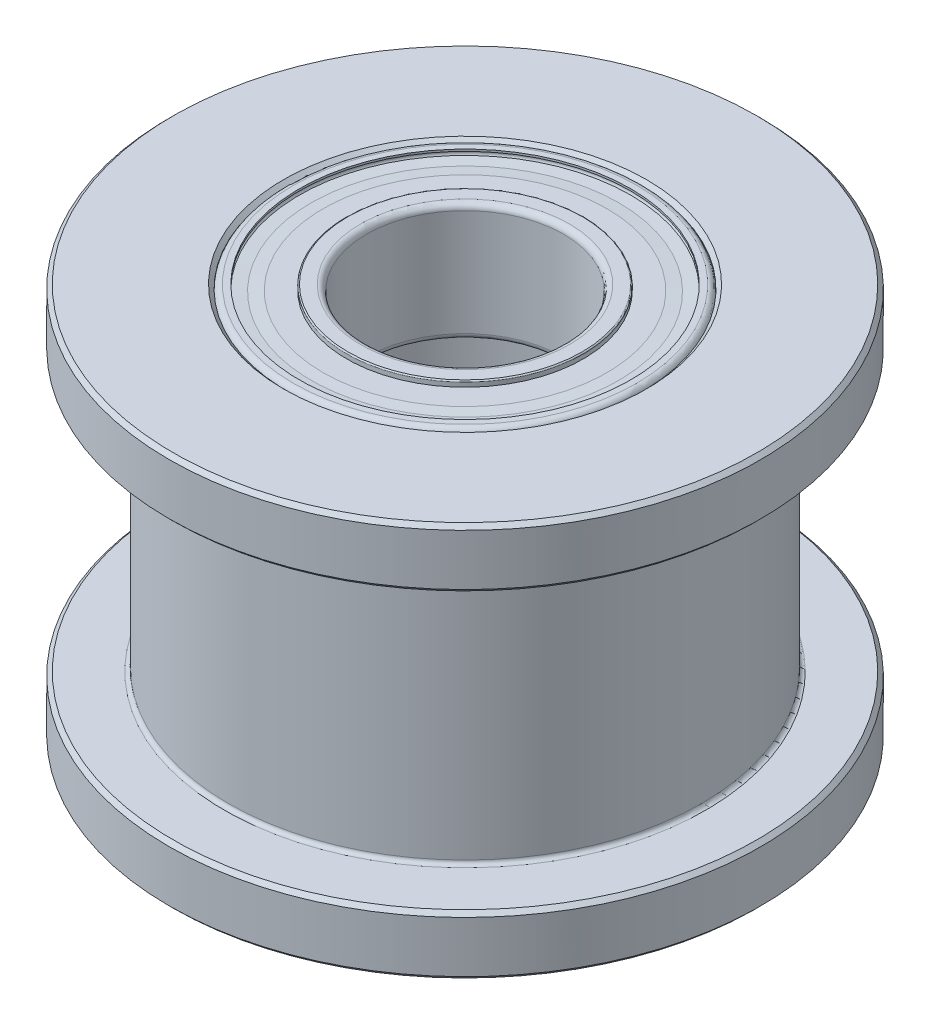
from build123d import *

# Parameters (mm, degrees)
ZKOSEN_1_SIZE      = 0.1
ZAOBLIT1_R         = 0.1
KRUHOV_POLE1_COUNT = 8
KRUHOV_POLE3_COUNT = 8


with BuildPart() as part:
    # Skica1 → Rotovat1 (revolve)
    with BuildSketch(Plane.XY, mode=Mode.PRIVATE) as rotovat1_sk:
        Polygon((4.5, 10), (7.5, 10), (7.5, 8.5), (6, 8.5), (6, 1.5), (7.5, 1.5), (7.5, 0), (4.5, 0), (4.5, 3), (3.5, 3), (3.5, 7), (4.5, 7), align=None)
    revolve(rotovat1_sk.sketch.rotate(Axis((0, 0, 0), (0, -1, 0)), 90), axis=Axis((0, 0, 0), (0, -1, 0)))

    # Zkosen_1
    zkosen_1_edges = [part.edges().sort_by_distance(p)[0] for p in [
        (0, 3, -3.5),
        (0, 0, -4.5),
        (0, 0, -7.5),
        (0, 1.5, -7.5),
        (0, 8.5, -7.5),
        (0, 10, -7.5),
        (0, 10, -4.5),
        (0, 7, -3.5),
    ]]
    chamfer(zkosen_1_edges, length=ZKOSEN_1_SIZE)

    # Zaoblit1
    zaoblit1_edges = [part.edges().sort_by_distance(p)[0] for p in [
        (0, 3, -4.5),
        (0, 1.5, -6),
        (0, 8.5, -6),
        (0, 7, -4.5),
    ]]
    fillet(zaoblit1_edges, radius=ZAOBLIT1_R)


with BuildPart() as body_2:
    # Skica4 → Rotovat2 (revolve)
    with BuildSketch(Plane.XY, mode=Mode.PRIVATE) as rotovat2_sk:
        with BuildLine():
            Line((4.5, 9.85), (4.5, 7.15))
            ThreePointArc((4.5, 7.15), (4.456066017, 7.043933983), (4.35, 7))
            Line((4.35, 7), (4.2, 7))
            Line((4.2, 7), (4.2, 7.05))
            ThreePointArc((4.2, 7.05), (4.289757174, 7.133393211), (4.213177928, 7.229030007))
            Line((4.213177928, 7.229030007), (3.85, 7.282786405))
            Line((3.85, 7.282786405), (3.85, 8.052786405))
            ThreePointArc((3.85, 8.052786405), (4.05, 8.5), (3.85, 8.947213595))
            Line((3.85, 8.947213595), (3.85, 9.717213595))
            Line((3.85, 9.717213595), (4.213177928, 9.770969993))
            ThreePointArc((4.213177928, 9.770969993), (4.289757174, 9.866606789), (4.2, 9.95))
            Line((4.2, 9.95), (4.2, 10))
            Line((4.2, 10), (4.35, 10))
            ThreePointArc((4.35, 10), (4.456066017, 9.956066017), (4.5, 9.85))
        make_face()
    revolve(rotovat2_sk.sketch.rotate(Axis((0, 0, 0), (0, 1, 0)), 90), axis=Axis((0, 0, 0), (0, 1, 0)))


with BuildPart() as body_3:
    # Skica5 → Rotovat3 (revolve)
    with BuildSketch(Plane.XY, mode=Mode.PRIVATE) as rotovat3_sk:
        with BuildLine():
            Line((2.5, 9.85), (2.5, 7.15))
            ThreePointArc((2.5, 7.15), (2.543933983, 7.043933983), (2.65, 7))
            Line((2.65, 7), (2.97, 7))
            ThreePointArc((2.97, 7), (2.991213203, 7.008786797), (3, 7.03))
            Line((3, 7.03), (3, 7.14))
            Line((3, 7.14), (3.6, 7.14))
            Line((3.6, 7.14), (3.896185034, 7.191714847))
            Line((3.896185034, 7.191714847), (4.192370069, 7.14))
            Line((4.192370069, 7.14), (4.192370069, 7.19))
            Line((4.192370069, 7.19), (3.897467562, 7.258062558))
            Line((3.897467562, 7.258062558), (3.597467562, 7.258062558))
            Line((3.597467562, 7.258062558), (3, 7.19))
            Line((3, 7.19), (3, 8.103137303))
            ThreePointArc((3, 8.103137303), (2.85, 8.5), (3, 8.896862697))
            Line((3, 8.896862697), (3, 9.81))
            Line((3, 9.81), (3.6, 9.77))
            Line((3.6, 9.77), (3.9, 9.77))
            Line((3.9, 9.77), (4.2, 9.81))
            Line((4.2, 9.81), (4.2, 9.86))
            Line((4.2, 9.86), (3.9, 9.84))
            Line((3.9, 9.84), (3.6, 9.86))
            Line((3.6, 9.86), (3, 9.86))
            Line((3, 9.86), (3, 9.97))
            ThreePointArc((3, 9.97), (2.991213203, 9.991213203), (2.97, 10))
            Line((2.97, 10), (2.65, 10))
            ThreePointArc((2.65, 10), (2.543933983, 9.956066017), (2.5, 9.85))
        make_face()
    revolve(rotovat3_sk.sketch.rotate(Axis((0, 0, 0), (0, 1, 0)), 90), axis=Axis((0, 0, 0), (0, 1, 0)))


with BuildPart() as body_4:
    # Skica6 → Rotovat4 (revolve)
    with BuildSketch(Plane.XY):
        with BuildLine():
            Line((3.45, 9.1), (3.45, 7.9))
            ThreePointArc((3.45, 7.9), (4.05, 8.5), (3.45, 9.1))
        make_face()
    revolve(axis=Axis((3.45, 9.1, 0), (0, -1, 0)))


with BuildPart() as kruhov_pole1_1:
    # Kruhov_ pole1: pattern copy
    add(body_4.part.rotate(Axis((0, 0, 0), (0, 1, 0)), 1 * 360 / KRUHOV_POLE1_COUNT))


with BuildPart() as kruhov_pole1_2:
    # Kruhov_ pole1: pattern copy
    add(body_4.part.rotate(Axis((0, 0, 0), (0, 1, 0)), 2 * 360 / KRUHOV_POLE1_COUNT))


with BuildPart() as kruhov_pole1_3:
    # Kruhov_ pole1: pattern copy
    add(body_4.part.rotate(Axis((0, 0, 0), (0, 1, 0)), 3 * 360 / KRUHOV_POLE1_COUNT))


with BuildPart() as kruhov_pole1_4:
    # Kruhov_ pole1: pattern copy
    add(body_4.part.rotate(Axis((0, 0, 0), (0, 1, 0)), 4 * 360 / KRUHOV_POLE1_COUNT))


with BuildPart() as kruhov_pole1_5:
    # Kruhov_ pole1: pattern copy
    add(body_4.part.rotate(Axis((0, 0, 0), (0, 1, 0)), 5 * 360 / KRUHOV_POLE1_COUNT))


with BuildPart() as kruhov_pole1_6:
    # Kruhov_ pole1: pattern copy
    add(body_4.part.rotate(Axis((0, 0, 0), (0, 1, 0)), 6 * 360 / KRUHOV_POLE1_COUNT))


with BuildPart() as kruhov_pole1_7:
    # Kruhov_ pole1: pattern copy
    add(body_4.part.rotate(Axis((0, 0, 0), (0, 1, 0)), 7 * 360 / KRUHOV_POLE1_COUNT))


with BuildPart() as body_12:
    # Skica7 → Rotovat5 (revolve)
    with BuildSketch(Plane.XY, mode=Mode.PRIVATE) as rotovat5_sk:
        with BuildLine():
            Line((4.5, 2.85), (4.5, 0.15))
            ThreePointArc((4.5, 0.15), (4.456066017, 0.043933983), (4.35, 0))
            Line((4.35, 0), (4.2, 0))
            Line((4.2, 0), (4.2, 0.05))
            ThreePointArc((4.2, 0.05), (4.289757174, 0.133393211), (4.213177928, 0.229030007))
            Line((4.213177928, 0.229030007), (3.85, 0.282786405))
            Line((3.85, 0.282786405), (3.85, 1.052786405))
            ThreePointArc((3.85, 1.052786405), (4.05, 1.5), (3.85, 1.947213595))
            Line((3.85, 1.947213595), (3.85, 2.717213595))
            Line((3.85, 2.717213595), (4.213177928, 2.770969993))
            ThreePointArc((4.213177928, 2.770969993), (4.289757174, 2.866606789), (4.2, 2.95))
            Line((4.2, 2.95), (4.2, 3))
            Line((4.2, 3), (4.35, 3))
            ThreePointArc((4.35, 3), (4.456066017, 2.956066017), (4.5, 2.85))
        make_face()
    revolve(rotovat5_sk.sketch.rotate(Axis((0, 0, 0), (0, 1, 0)), 90), axis=Axis((0, 0, 0), (0, 1, 0)))


with BuildPart() as body_13:
    # Skica8 → Rotovat6 (revolve)
    with BuildSketch(Plane.XY, mode=Mode.PRIVATE) as rotovat6_sk:
        with BuildLine():
            Line((2.5, 2.85), (2.5, 0.15))
            ThreePointArc((2.5, 0.15), (2.543933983, 0.043933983), (2.65, 0))
            Line((2.65, 0), (2.97, 0))
            ThreePointArc((2.97, 0), (2.991213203, 0.008786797), (3, 0.03))
            Line((3, 0.03), (3, 0.14))
            Line((3, 0.14), (3.6, 0.14))
            Line((3.6, 0.14), (3.896185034, 0.191714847))
            Line((3.896185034, 0.191714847), (4.192370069, 0.14))
            Line((4.192370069, 0.14), (4.192370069, 0.19))
            Line((4.192370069, 0.19), (3.897467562, 0.258062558))
            Line((3.897467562, 0.258062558), (3.597467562, 0.258062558))
            Line((3.597467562, 0.258062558), (3, 0.19))
            Line((3, 0.19), (3, 1.103137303))
            ThreePointArc((3, 1.103137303), (2.85, 1.5), (3, 1.896862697))
            Line((3, 1.896862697), (3, 2.81))
            Line((3, 2.81), (3.6, 2.77))
            Line((3.6, 2.77), (3.9, 2.77))
            Line((3.9, 2.77), (4.2, 2.81))
            Line((4.2, 2.81), (4.2, 2.86))
            Line((4.2, 2.86), (3.9, 2.84))
            Line((3.9, 2.84), (3.6, 2.86))
            Line((3.6, 2.86), (3, 2.86))
            Line((3, 2.86), (3, 2.97))
            ThreePointArc((3, 2.97), (2.991213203, 2.991213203), (2.97, 3))
            Line((2.97, 3), (2.65, 3))
            ThreePointArc((2.65, 3), (2.543933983, 2.956066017), (2.5, 2.85))
        make_face()
    revolve(rotovat6_sk.sketch.rotate(Axis((0, 0, 0), (0, -1, 0)), 180), axis=Axis((0, 0, 0), (0, -1, 0)))


with BuildPart() as body_14:
    # Skica9 → Rotovat7 (revolve)
    with BuildSketch(Plane.XY):
        with BuildLine():
            Line((3.45, 2.1), (3.45, 0.9))
            ThreePointArc((3.45, 0.9), (4.05, 1.5), (3.45, 2.1))
        make_face()
    revolve(axis=Axis((3.45, 2.1, 0), (0, -1, 0)))


with BuildPart() as kruhov_pole3_1:
    # Kruhov_ pole3: pattern copy
    add(body_14.part.rotate(Axis((0, 0, 0), (0, 1, 0)), 1 * 360 / KRUHOV_POLE3_COUNT))


with BuildPart() as kruhov_pole3_2:
    # Kruhov_ pole3: pattern copy
    add(body_14.part.rotate(Axis((0, 0, 0), (0, 1, 0)), 2 * 360 / KRUHOV_POLE3_COUNT))


with BuildPart() as kruhov_pole3_3:
    # Kruhov_ pole3: pattern copy
    add(body_14.part.rotate(Axis((0, 0, 0), (0, 1, 0)), 3 * 360 / KRUHOV_POLE3_COUNT))


with BuildPart() as kruhov_pole3_4:
    # Kruhov_ pole3: pattern copy
    add(body_14.part.rotate(Axis((0, 0, 0), (0, 1, 0)), 4 * 360 / KRUHOV_POLE3_COUNT))


with BuildPart() as kruhov_pole3_5:
    # Kruhov_ pole3: pattern copy
    add(body_14.part.rotate(Axis((0, 0, 0), (0, 1, 0)), 5 * 360 / KRUHOV_POLE3_COUNT))


with BuildPart() as kruhov_pole3_6:
    # Kruhov_ pole3: pattern copy
    add(body_14.part.rotate(Axis((0, 0, 0), (0, 1, 0)), 6 * 360 / KRUHOV_POLE3_COUNT))


with BuildPart() as kruhov_pole3_7:
    # Kruhov_ pole3: pattern copy
    add(body_14.part.rotate(Axis((0, 0, 0), (0, 1, 0)), 7 * 360 / KRUHOV_POLE3_COUNT))


solid = Compound([part.part, body_2.part, body_3.part, body_4.part, kruhov_pole1_1.part, kruhov_pole1_2.part, kruhov_pole1_3.part, kruhov_pole1_4.part, kruhov_pole1_5.part, kruhov_pole1_6.part, kruhov_pole1_7.part, body_12.part, body_13.part, body_14.part, kruhov_pole3_1.part, kruhov_pole3_2.part, kruhov_pole3_3.part, kruhov_pole3_4.part, kruhov_pole3_5.part, kruhov_pole3_6.part, kruhov_pole3_7.part])
